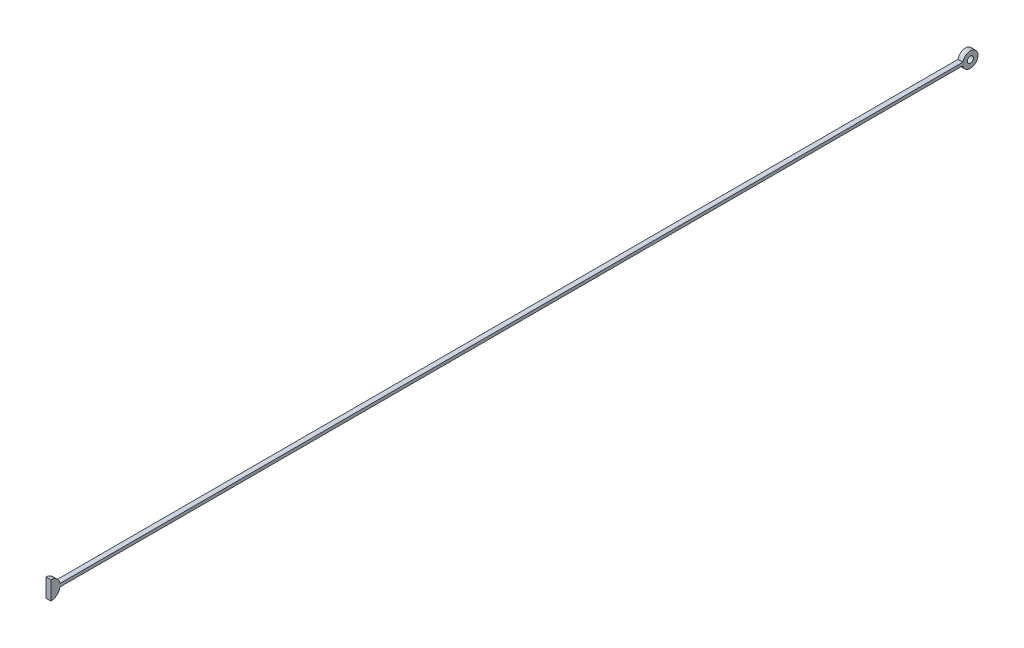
ISO-10303-21;
HEADER;
FILE_DESCRIPTION(('STEP AP214'),'2;1');
FILE_NAME('part.step','',(''),(''),'','','');
FILE_SCHEMA(('AUTOMOTIVE_DESIGN { 1 0 10303 214 1 1 1 1 }'));
ENDSEC;
DATA;
#1=APPLICATION_CONTEXT('core data for automotive mechanical design processes');
#2=APPLICATION_PROTOCOL_DEFINITION('international standard','automotive_design',2000,#1);
#3=PRODUCT_CONTEXT('',#1,'mechanical');
#4=PRODUCT('Part','Part','',(#3));
#5=PRODUCT_RELATED_PRODUCT_CATEGORY('part','',(#4));
#6=PRODUCT_DEFINITION_FORMATION('','',#4);
#7=PRODUCT_DEFINITION_CONTEXT('part definition',#1,'design');
#8=PRODUCT_DEFINITION('design','',#6,#7);
#9=PRODUCT_DEFINITION_SHAPE('','',#8);
#10=(LENGTH_UNIT() NAMED_UNIT(*) SI_UNIT(.MILLI.,.METRE.));
#11=(NAMED_UNIT(*) PLANE_ANGLE_UNIT() SI_UNIT($,.RADIAN.));
#12=(NAMED_UNIT(*) SI_UNIT($,.STERADIAN.) SOLID_ANGLE_UNIT());
#13=UNCERTAINTY_MEASURE_WITH_UNIT(LENGTH_MEASURE(1.E-05),#10,'distance_accuracy_value','');
#14=(GEOMETRIC_REPRESENTATION_CONTEXT(3) GLOBAL_UNCERTAINTY_ASSIGNED_CONTEXT((#13)) GLOBAL_UNIT_ASSIGNED_CONTEXT((#10,
#11,#12)) REPRESENTATION_CONTEXT('',''));
#15=CARTESIAN_POINT('',(0.,0.,0.));
#16=DIRECTION('',(0.,0.,1.));
#17=DIRECTION('',(1.,0.,0.));
#18=AXIS2_PLACEMENT_3D('',#15,#16,#17);
#19=CARTESIAN_POINT('',(8.,0.,1500.));
#20=DIRECTION('',(1.,0.,0.));
#21=DIRECTION('',(0.,0.,-1.));
#22=AXIS2_PLACEMENT_3D('',#19,#20,#21);
#23=PLANE('',#22);
#24=CARTESIAN_POINT('',(8.,0.,1500.));
#25=DIRECTION('',(1.,0.,0.));
#26=DIRECTION('',(0.,0.,-1.));
#27=AXIS2_PLACEMENT_3D('',#24,#25,#26);
#28=CIRCLE('',#27,15.);
#29=CARTESIAN_POINT('',(8.,2.5,1485.20980054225));
#30=VERTEX_POINT('',#29);
#31=CARTESIAN_POINT('',(8.,15.,1500.));
#32=VERTEX_POINT('',#31);
#33=EDGE_CURVE('E132',#30,#32,#28,.T.);
#34=ORIENTED_EDGE('',*,*,#33,.T.);
#35=DIRECTION('',(0.,-1.,0.));
#36=VECTOR('',#35,1.);
#37=CARTESIAN_POINT('',(8.,15.,1500.));
#38=LINE('',#37,#36);
#39=CARTESIAN_POINT('',(8.,-15.,1500.));
#40=VERTEX_POINT('',#39);
#41=EDGE_CURVE('E90',#32,#40,#38,.T.);
#42=ORIENTED_EDGE('',*,*,#41,.T.);
#43=CARTESIAN_POINT('',(8.,0.,1500.));
#44=DIRECTION('',(1.,0.,0.));
#45=DIRECTION('',(0.,0.,-1.));
#46=AXIS2_PLACEMENT_3D('',#43,#44,#45);
#47=CIRCLE('',#46,15.);
#48=CARTESIAN_POINT('',(8.,-2.5,1485.20980054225));
#49=VERTEX_POINT('',#48);
#50=EDGE_CURVE('E103',#40,#49,#47,.T.);
#51=ORIENTED_EDGE('',*,*,#50,.T.);
#52=DIRECTION('',(0.,0.,-1.));
#53=VECTOR('',#52,1.);
#54=CARTESIAN_POINT('',(8.,-2.5,1485.20980054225));
#55=LINE('',#54,#53);
#56=CARTESIAN_POINT('',(8.,-2.5,12.2474487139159));
#57=VERTEX_POINT('',#56);
#58=EDGE_CURVE('E97',#49,#57,#55,.T.);
#59=ORIENTED_EDGE('',*,*,#58,.T.);
#60=CARTESIAN_POINT('',(8.,0.,0.));
#61=DIRECTION('',(1.,0.,0.));
#62=DIRECTION('',(0.,0.,-1.));
#63=AXIS2_PLACEMENT_3D('',#60,#61,#62);
#64=CIRCLE('',#63,12.5);
#65=CARTESIAN_POINT('',(8.,2.5,12.2474487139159));
#66=VERTEX_POINT('',#65);
#67=EDGE_CURVE('E101',#57,#66,#64,.T.);
#68=ORIENTED_EDGE('',*,*,#67,.T.);
#69=DIRECTION('',(0.,0.,1.));
#70=VECTOR('',#69,1.);
#71=CARTESIAN_POINT('',(8.,2.5,1485.20980054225));
#72=LINE('',#71,#70);
#73=EDGE_CURVE('E53',#66,#30,#72,.T.);
#74=ORIENTED_EDGE('',*,*,#73,.T.);
#75=EDGE_LOOP('',(#34,#42,#51,#59,#68,#74));
#76=FACE_BOUND('',#75,.T.);
#77=CARTESIAN_POINT('',(8.,0.,0.));
#78=DIRECTION('',(1.,0.,0.));
#79=DIRECTION('',(0.,0.,-1.));
#80=AXIS2_PLACEMENT_3D('',#77,#78,#79);
#81=CIRCLE('',#80,5.);
#82=CARTESIAN_POINT('',(8.,0.,-5.));
#83=VERTEX_POINT('',#82);
#84=EDGE_CURVE('E125',#83,#83,#81,.T.);
#85=ORIENTED_EDGE('',*,*,#84,.F.);
#86=EDGE_LOOP('',(#85));
#87=FACE_BOUND('',#86,.T.);
#88=ADVANCED_FACE('F36',(#76,#87),#23,.T.);
#89=CARTESIAN_POINT('',(0.,0.,1500.));
#90=DIRECTION('',(1.,0.,0.));
#91=DIRECTION('',(0.,0.,-1.));
#92=AXIS2_PLACEMENT_3D('',#89,#90,#91);
#93=PLANE('',#92);
#94=CARTESIAN_POINT('',(0.,0.,1500.));
#95=DIRECTION('',(1.,0.,0.));
#96=DIRECTION('',(0.,0.,-1.));
#97=AXIS2_PLACEMENT_3D('',#94,#95,#96);
#98=CIRCLE('',#97,15.);
#99=CARTESIAN_POINT('',(0.,2.5,1485.20980054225));
#100=VERTEX_POINT('',#99);
#101=CARTESIAN_POINT('',(0.,15.,1500.));
#102=VERTEX_POINT('',#101);
#103=EDGE_CURVE('E121',#100,#102,#98,.T.);
#104=ORIENTED_EDGE('',*,*,#103,.F.);
#105=DIRECTION('',(0.,0.,1.));
#106=VECTOR('',#105,1.);
#107=CARTESIAN_POINT('',(0.,2.5,1485.20980054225));
#108=LINE('',#107,#106);
#109=CARTESIAN_POINT('',(0.,2.5,12.2474487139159));
#110=VERTEX_POINT('',#109);
#111=EDGE_CURVE('E82',#110,#100,#108,.T.);
#112=ORIENTED_EDGE('',*,*,#111,.F.);
#113=CARTESIAN_POINT('',(0.,0.,0.));
#114=DIRECTION('',(1.,0.,0.));
#115=DIRECTION('',(0.,0.,-1.));
#116=AXIS2_PLACEMENT_3D('',#113,#114,#115);
#117=CIRCLE('',#116,12.5);
#118=CARTESIAN_POINT('',(0.,-2.5,12.2474487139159));
#119=VERTEX_POINT('',#118);
#120=EDGE_CURVE('E76',#119,#110,#117,.T.);
#121=ORIENTED_EDGE('',*,*,#120,.F.);
#122=DIRECTION('',(0.,0.,-1.));
#123=VECTOR('',#122,1.);
#124=CARTESIAN_POINT('',(0.,-2.5,1485.20980054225));
#125=LINE('',#124,#123);
#126=CARTESIAN_POINT('',(0.,-2.5,1485.20980054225));
#127=VERTEX_POINT('',#126);
#128=EDGE_CURVE('E111',#127,#119,#125,.T.);
#129=ORIENTED_EDGE('',*,*,#128,.F.);
#130=CARTESIAN_POINT('',(0.,0.,1500.));
#131=DIRECTION('',(1.,0.,0.));
#132=DIRECTION('',(0.,0.,-1.));
#133=AXIS2_PLACEMENT_3D('',#130,#131,#132);
#134=CIRCLE('',#133,15.);
#135=CARTESIAN_POINT('',(0.,-15.,1500.));
#136=VERTEX_POINT('',#135);
#137=EDGE_CURVE('E127',#136,#127,#134,.T.);
#138=ORIENTED_EDGE('',*,*,#137,.F.);
#139=DIRECTION('',(0.,-1.,0.));
#140=VECTOR('',#139,1.);
#141=CARTESIAN_POINT('',(0.,15.,1500.));
#142=LINE('',#141,#140);
#143=EDGE_CURVE('E124',#102,#136,#142,.T.);
#144=ORIENTED_EDGE('',*,*,#143,.F.);
#145=EDGE_LOOP('',(#104,#112,#121,#129,#138,#144));
#146=FACE_BOUND('',#145,.T.);
#147=CARTESIAN_POINT('',(0.,0.,0.));
#148=DIRECTION('',(1.,0.,0.));
#149=DIRECTION('',(0.,0.,-1.));
#150=AXIS2_PLACEMENT_3D('',#147,#148,#149);
#151=CIRCLE('',#150,5.);
#152=CARTESIAN_POINT('',(0.,0.,-5.));
#153=VERTEX_POINT('',#152);
#154=EDGE_CURVE('E225',#153,#153,#151,.T.);
#155=ORIENTED_EDGE('',*,*,#154,.T.);
#156=EDGE_LOOP('',(#155));
#157=FACE_BOUND('',#156,.T.);
#158=ADVANCED_FACE('F141',(#146,#157),#93,.F.);
#159=CARTESIAN_POINT('',(8.,0.,1500.));
#160=DIRECTION('',(-1.,0.,0.));
#161=DIRECTION('',(0.,0.,1.));
#162=AXIS2_PLACEMENT_3D('',#159,#160,#161);
#163=CYLINDRICAL_SURFACE('',#162,15.);
#164=ORIENTED_EDGE('',*,*,#103,.T.);
#165=DIRECTION('',(-1.,0.,0.));
#166=VECTOR('',#165,1.);
#167=CARTESIAN_POINT('',(8.,15.,1500.));
#168=LINE('',#167,#166);
#169=EDGE_CURVE('E11',#32,#102,#168,.T.);
#170=ORIENTED_EDGE('',*,*,#169,.F.);
#171=ORIENTED_EDGE('',*,*,#33,.F.);
#172=DIRECTION('',(-1.,0.,0.));
#173=VECTOR('',#172,1.);
#174=CARTESIAN_POINT('',(8.,2.5,1485.20980054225));
#175=LINE('',#174,#173);
#176=EDGE_CURVE('E117',#30,#100,#175,.T.);
#177=ORIENTED_EDGE('',*,*,#176,.T.);
#178=EDGE_LOOP('',(#164,#170,#171,#177));
#179=FACE_BOUND('',#178,.T.);
#180=ADVANCED_FACE('F38',(#179),#163,.T.);
#181=CARTESIAN_POINT('',(8.,15.,1500.));
#182=DIRECTION('',(0.,0.,-1.));
#183=DIRECTION('',(-1.,0.,0.));
#184=AXIS2_PLACEMENT_3D('',#181,#182,#183);
#185=PLANE('',#184);
#186=ORIENTED_EDGE('',*,*,#143,.T.);
#187=DIRECTION('',(-1.,0.,0.));
#188=VECTOR('',#187,1.);
#189=CARTESIAN_POINT('',(8.,-15.,1500.));
#190=LINE('',#189,#188);
#191=EDGE_CURVE('E45',#40,#136,#190,.T.);
#192=ORIENTED_EDGE('',*,*,#191,.F.);
#193=ORIENTED_EDGE('',*,*,#41,.F.);
#194=ORIENTED_EDGE('',*,*,#169,.T.);
#195=EDGE_LOOP('',(#186,#192,#193,#194));
#196=FACE_BOUND('',#195,.T.);
#197=ADVANCED_FACE('F166',(#196),#185,.F.);
#198=CARTESIAN_POINT('',(8.,0.,1500.));
#199=DIRECTION('',(-1.,0.,0.));
#200=DIRECTION('',(0.,0.,1.));
#201=AXIS2_PLACEMENT_3D('',#198,#199,#200);
#202=CYLINDRICAL_SURFACE('',#201,15.);
#203=ORIENTED_EDGE('',*,*,#137,.T.);
#204=DIRECTION('',(-1.,0.,0.));
#205=VECTOR('',#204,1.);
#206=CARTESIAN_POINT('',(8.,-2.5,1485.20980054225));
#207=LINE('',#206,#205);
#208=EDGE_CURVE('E112',#49,#127,#207,.T.);
#209=ORIENTED_EDGE('',*,*,#208,.F.);
#210=ORIENTED_EDGE('',*,*,#50,.F.);
#211=ORIENTED_EDGE('',*,*,#191,.T.);
#212=EDGE_LOOP('',(#203,#209,#210,#211));
#213=FACE_BOUND('',#212,.T.);
#214=ADVANCED_FACE('F138',(#213),#202,.T.);
#215=CARTESIAN_POINT('',(8.,-2.5,1485.20980054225));
#216=DIRECTION('',(0.,1.,0.));
#217=DIRECTION('',(0.,0.,1.));
#218=AXIS2_PLACEMENT_3D('',#215,#216,#217);
#219=PLANE('',#218);
#220=ORIENTED_EDGE('',*,*,#128,.T.);
#221=DIRECTION('',(-1.,0.,0.));
#222=VECTOR('',#221,1.);
#223=CARTESIAN_POINT('',(8.,-2.5,12.2474487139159));
#224=LINE('',#223,#222);
#225=EDGE_CURVE('E108',#57,#119,#224,.T.);
#226=ORIENTED_EDGE('',*,*,#225,.F.);
#227=ORIENTED_EDGE('',*,*,#58,.F.);
#228=ORIENTED_EDGE('',*,*,#208,.T.);
#229=EDGE_LOOP('',(#220,#226,#227,#228));
#230=FACE_BOUND('',#229,.T.);
#231=ADVANCED_FACE('F109',(#230),#219,.F.);
#232=CARTESIAN_POINT('',(8.,0.,0.));
#233=DIRECTION('',(-1.,0.,0.));
#234=DIRECTION('',(0.,0.,1.));
#235=AXIS2_PLACEMENT_3D('',#232,#233,#234);
#236=CYLINDRICAL_SURFACE('',#235,12.5);
#237=ORIENTED_EDGE('',*,*,#120,.T.);
#238=DIRECTION('',(-1.,0.,0.));
#239=VECTOR('',#238,1.);
#240=CARTESIAN_POINT('',(8.,2.5,12.2474487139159));
#241=LINE('',#240,#239);
#242=EDGE_CURVE('E113',#66,#110,#241,.T.);
#243=ORIENTED_EDGE('',*,*,#242,.F.);
#244=ORIENTED_EDGE('',*,*,#67,.F.);
#245=ORIENTED_EDGE('',*,*,#225,.T.);
#246=EDGE_LOOP('',(#237,#243,#244,#245));
#247=FACE_BOUND('',#246,.T.);
#248=ADVANCED_FACE('F115',(#247),#236,.T.);
#249=CARTESIAN_POINT('',(8.,2.5,1485.20980054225));
#250=DIRECTION('',(0.,-1.,0.));
#251=DIRECTION('',(0.,0.,-1.));
#252=AXIS2_PLACEMENT_3D('',#249,#250,#251);
#253=PLANE('',#252);
#254=ORIENTED_EDGE('',*,*,#111,.T.);
#255=ORIENTED_EDGE('',*,*,#176,.F.);
#256=ORIENTED_EDGE('',*,*,#73,.F.);
#257=ORIENTED_EDGE('',*,*,#242,.T.);
#258=EDGE_LOOP('',(#254,#255,#256,#257));
#259=FACE_BOUND('',#258,.T.);
#260=ADVANCED_FACE('F146',(#259),#253,.F.);
#261=CARTESIAN_POINT('',(8.,0.,0.));
#262=DIRECTION('',(-1.,0.,0.));
#263=DIRECTION('',(0.,0.,1.));
#264=AXIS2_PLACEMENT_3D('',#261,#262,#263);
#265=CYLINDRICAL_SURFACE('',#264,5.);
#266=ORIENTED_EDGE('',*,*,#84,.T.);
#267=EDGE_LOOP('',(#266));
#268=FACE_BOUND('',#267,.T.);
#269=ORIENTED_EDGE('',*,*,#154,.F.);
#270=EDGE_LOOP('',(#269));
#271=FACE_BOUND('',#270,.T.);
#272=ADVANCED_FACE('F148',(#268,#271),#265,.F.);
#273=CLOSED_SHELL('',(#88,#158,#180,#197,#214,#231,#248,#260,#272));
#274=MANIFOLD_SOLID_BREP('B2',#273);
#275=ADVANCED_BREP_SHAPE_REPRESENTATION('',(#18,#274),#14);
#276=SHAPE_DEFINITION_REPRESENTATION(#9,#275);
ENDSEC;
END-ISO-10303-21;
